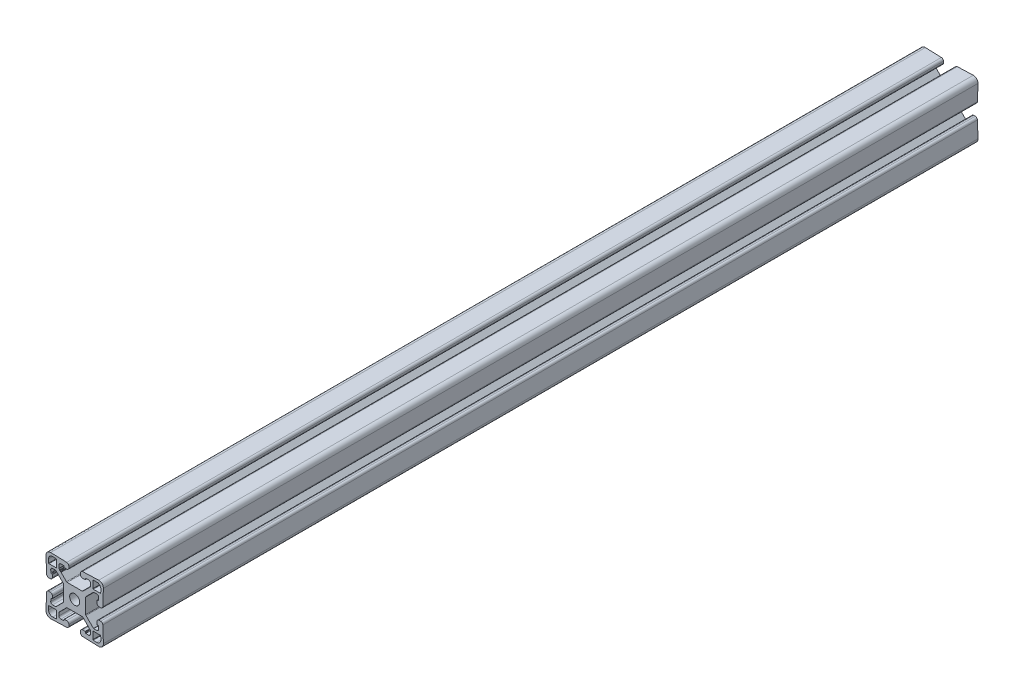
from build123d import *

# Parameters (mm, degrees)
BOSS_EXTRUDE1_DEPTH     = 304.8
CIRPATTERN1_COUNT       = 4
CUT_EXTRUDE1_DEPTH      = 307.109522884
CUT_EXTRUDE1_DEPTH_BACK = 307.109522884


with BuildPart() as part:
    # Sketch3 → Boss-Extrude1 (new, symmetric)
    with BuildSketch(Plane.XY):
        with BuildLine():
            Line((-7.681, 0), (-7.681, 5.210107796))
            ThreePointArc((-7.681, 5.210107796), (-7.739003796, 5.501712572), (-7.904184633, 5.748923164))
            Line((-7.904184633, 5.748923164), (-13.062267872, 10.907006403))
            ThreePointArc((-13.062267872, 10.907006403), (-13.165272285, 10.975831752), (-13.286774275, 11))
            Line((-13.286774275, 11), (-15.433540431, 11))
            ThreePointArc((-15.433540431, 11), (-16.347101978, 10.61221613), (-16.702766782, 9.685677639))
            Line((-16.702766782, 9.685677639), (-16.637141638, 7.80641941))
            ThreePointArc((-16.637141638, 7.80641941), (-16.540389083, 7.589109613), (-16.319835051, 7.5))
            Line((-16.319835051, 7.5), (-15.916428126, 7.5))
            ThreePointArc((-15.916428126, 7.5), (-15.695874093, 7.410890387), (-15.599121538, 7.19358059))
            Line((-15.599121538, 7.19358059), (-15.544946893, 5.642221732))
            ThreePointArc((-15.544946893, 5.642221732), (-15.972024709, 4.529645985), (-17.069017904, 4.064))
            Line((-17.069017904, 4.064), (-18.083635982, 4.064))
            ThreePointArc((-18.083635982, 4.064), (-19.142989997, 4.492006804), (-19.607706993, 5.535778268))
            Line((-19.607706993, 5.535778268), (-19.998065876, 16.714194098))
            ThreePointArc((-19.998065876, 16.714194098), (-19.07006403, 19.07006403), (-16.714194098, 19.998065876))
            Line((-16.714194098, 19.998065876), (-5.535778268, 19.607706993))
            ThreePointArc((-5.535778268, 19.607706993), (-4.492006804, 19.142989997), (-4.064, 18.083635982))
            Line((-4.064, 18.083635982), (-4.064, 17.069017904))
            ThreePointArc((-4.064, 17.069017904), (-4.529645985, 15.972024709), (-5.642221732, 15.544946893))
            Line((-5.642221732, 15.544946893), (-7.19358059, 15.599121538))
            ThreePointArc((-7.19358059, 15.599121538), (-7.410890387, 15.695874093), (-7.5, 15.916428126))
            Line((-7.5, 15.916428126), (-7.5, 16.319835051))
            ThreePointArc((-7.5, 16.319835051), (-7.589109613, 16.540389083), (-7.80641941, 16.637141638))
            Line((-7.80641941, 16.637141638), (-9.685677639, 16.702766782))
            ThreePointArc((-9.685677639, 16.702766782), (-10.61221613, 16.347101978), (-11, 15.433540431))
            Line((-11, 15.433540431), (-11, 13.286774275))
            ThreePointArc((-11, 13.286774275), (-10.975831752, 13.165272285), (-10.907006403, 13.062267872))
            Line((-10.907006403, 13.062267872), (-5.748923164, 7.904184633))
            ThreePointArc((-5.748923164, 7.904184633), (-5.501712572, 7.739003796), (-5.210107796, 7.681))
            Line((-5.210107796, 7.681), (0, 7.681))
            Line((0, 7.681), (0, 3.5))
            ThreePointArc((0, 3.5), (-2.474873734, 2.474873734), (-3.5, 0))
            Line((-3.5, 0), (-7.681, 0))
        make_face()
        with BuildLine():
            Line((-18.220706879, 15.330899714), (-18.136032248, 12.906135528))
            ThreePointArc((-18.136032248, 12.906135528), (-18.058630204, 12.732287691), (-17.882186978, 12.661))
            Line((-17.882186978, 12.661), (-12.915, 12.661))
            ThreePointArc((-12.915, 12.661), (-12.735394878, 12.735394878), (-12.661, 12.915))
            Line((-12.661, 12.915), (-12.661, 17.882186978))
            ThreePointArc((-12.661, 17.882186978), (-12.732287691, 18.058630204), (-12.906135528, 18.136032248))
            Line((-12.906135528, 18.136032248), (-15.330899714, 18.220706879))
            ThreePointArc((-15.330899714, 18.220706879), (-17.404065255, 17.404065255), (-18.220706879, 15.330899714))
        make_face(mode=Mode.SUBTRACT)
    boss_extrude1 = extrude(amount=BOSS_EXTRUDE1_DEPTH, both=True)

    # CirPattern1: Boss-Extrude1 ×4 about axis
    cirpattern1_axis = Axis((0, 0, 0), (0, 0, 1))
    for i in range(1, CIRPATTERN1_COUNT):
        add(boss_extrude1.rotate(cirpattern1_axis, i * 360 / CIRPATTERN1_COUNT))

    # Sketch4 → Cut-Extrude1 (cut, two sides: drawn at the far end of the back side and taken through both)
    with BuildSketch(Plane.XY.offset(-CUT_EXTRUDE1_DEPTH_BACK)):
        Polygon((-10.505738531, 12.661), (-9.505738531, 12.661), (-9.505738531, 11.661), (-9.839071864, 11.661), (-9.839071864, 11.994333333), (-10.172405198, 12.327666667), (-10.505738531, 12.327666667), align=None)
    extrude(amount=CUT_EXTRUDE1_DEPTH + CUT_EXTRUDE1_DEPTH_BACK, mode=Mode.SUBTRACT)


solid = part.part
